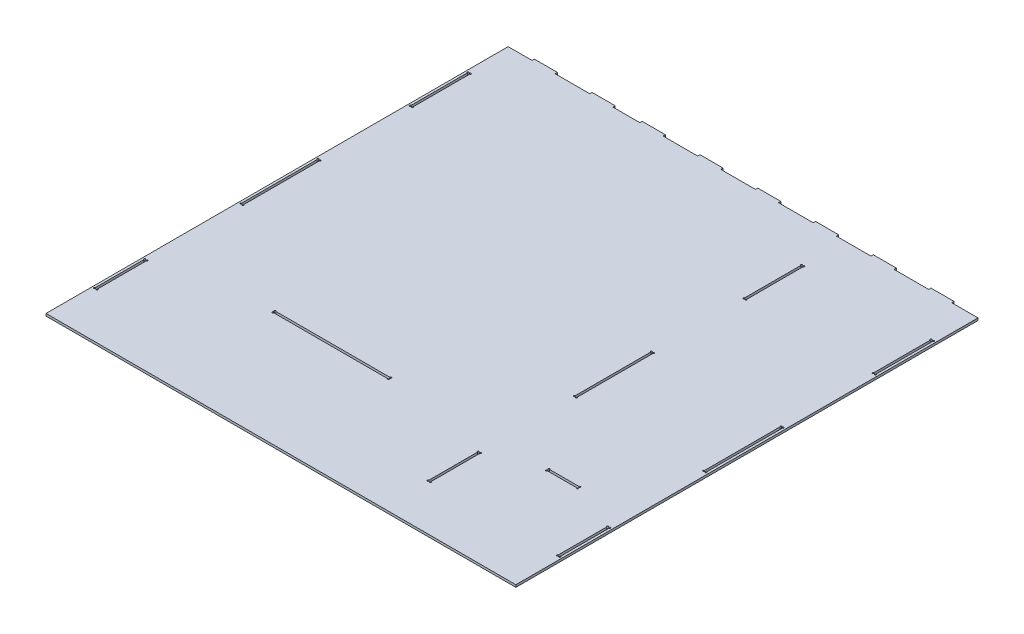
from build123d import *

# Parameters (mm, degrees)
SKETCH1_W             = 50
SKETCH1_H             = 6
BOSS_EXTRUDE1_DEPTH   = 1200
SKETCH1_W_2           = 90
BOSS_EXTRUDE1_2_DEPTH = 1200
SKETCH1_W_3           = 70
BOSS_EXTRUDE1_3_DEPTH = 1200
BOSS_EXTRUDE1_4_DEPTH = 1200
BOSS_EXTRUDE1_5_DEPTH = 1200
BOSS_EXTRUDE1_6_DEPTH = 1200
BOSS_EXTRUDE1_7_DEPTH = 1200
BOSS_EXTRUDE1_8_DEPTH = 1200
SKETCH1_W_4           = 56
BOSS_EXTRUDE1_9_DEPTH = 1200
SKETCH2_W             = 90
SKETCH2_H             = 1200
SKETCH2_W_2           = 60
SKETCH2_H_2           = 6
SKETCH2_W_3           = 60.015443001
BOSS_EXTRUDE2_DEPTH   = 6
SKETCH3_W             = 12
SKETCH3_H             = 6
BOSS_EXTRUDE3_DEPTH   = 1200
CUT_EXTRUDE1_DEPTH    = 151
SKETCH6_R             = 2
CUT_EXTRUDE2_DEPTH    = 10
SKETCH7_R             = 2
CUT_EXTRUDE3_DEPTH    = 10
CUT_EXTRUDE5_DEPTH    = 20


with BuildPart() as part:
    # Sketch1 → Boss-Extrude1 (new body)
    with BuildSketch(Plane.XY):
        with Locations((-573, 171)):
            Rectangle(SKETCH1_W, SKETCH1_H)
    extrude(amount=BOSS_EXTRUDE1_DEPTH)



with BuildPart() as body_2:
    # Sketch1 → Boss-Extrude1 2 (new body)
    with BuildSketch(Plane.XY):
        with Locations((-443, 171)):
            Rectangle(SKETCH1_W_2, SKETCH1_H)
    extrude(amount=BOSS_EXTRUDE1_2_DEPTH)


with BuildPart() as body_3:
    # Sketch1 → Boss-Extrude1 3 (new body)
    with BuildSketch(Plane.XY):
        with Locations((-303, 171)):
            Rectangle(SKETCH1_W_3, SKETCH1_H)
    extrude(amount=BOSS_EXTRUDE1_3_DEPTH)


with BuildPart() as body_4:
    # Sketch1 → Boss-Extrude1 4 (new body)
    with BuildSketch(Plane.XY):
        with Locations((-163, 171)):
            Rectangle(SKETCH1_W_2, SKETCH1_H)
    extrude(amount=BOSS_EXTRUDE1_4_DEPTH)


with BuildPart() as body_5:
    # Sketch1 → Boss-Extrude1 5 (new body)
    with BuildSketch(Plane.XY):
        with Locations((-13, 171)):
            Rectangle(SKETCH1_W_2, SKETCH1_H)
    extrude(amount=BOSS_EXTRUDE1_5_DEPTH)


with BuildPart() as body_6:
    # Sketch1 → Boss-Extrude1 6 (new body)
    with BuildSketch(Plane.XY):
        with Locations((137, 171)):
            Rectangle(SKETCH1_W_2, SKETCH1_H)
    extrude(amount=BOSS_EXTRUDE1_6_DEPTH)


with BuildPart() as body_7:
    # Sketch1 → Boss-Extrude1 7 (new body)
    with BuildSketch(Plane.XY):
        with Locations((287, 171)):
            Rectangle(SKETCH1_W_2, SKETCH1_H)
    extrude(amount=BOSS_EXTRUDE1_7_DEPTH)


with BuildPart() as body_8:
    # Sketch1 → Boss-Extrude1 8 (new body)
    with BuildSketch(Plane.XY):
        with Locations((437, 171)):
            Rectangle(SKETCH1_W_2, SKETCH1_H)
    extrude(amount=BOSS_EXTRUDE1_8_DEPTH)


with BuildPart() as body_9:
    # Sketch1 → Boss-Extrude1 9 (new body)
    with BuildSketch(Plane.XY):
        with Locations((570, 171)):
            Rectangle(SKETCH1_W_4, SKETCH1_H)
    extrude(amount=BOSS_EXTRUDE1_9_DEPTH)


with BuildPart() as part_1:
    add(part.part)

    add(body_2.part)  # Boss-Extrude2 merges body 2

    add(body_3.part)  # Boss-Extrude2 merges body 3

    add(body_4.part)  # Boss-Extrude2 merges body 4

    add(body_5.part)  # Boss-Extrude2 merges body 5

    add(body_6.part)  # Boss-Extrude2 merges body 6

    add(body_7.part)  # Boss-Extrude2 merges body 7

    add(body_8.part)  # Boss-Extrude2 merges body 8

    add(body_9.part)  # Boss-Extrude2 merges body 9
    # Sketch2 → Boss-Extrude2 (add)
    with BuildSketch(Plane.XZ.offset(-168)):
        Polygon((-598, 0), (-548, 0), (-488, 0), (-488, 1200), (-598, 1200), align=None)
        Polygon((-398, 1200), (-398, 0), (-337.984556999, 0), (-268, 0), (-208, 0), (-118, 0), (-58, 0), (32, 0), (92, 0), (182, 0), (242, 0), (332, 0), (392, 0), (482, 0), (542, 0), (598, 0), (598, 1200), align=None)
        with Locations((-443, 600)):
            Rectangle(SKETCH2_W, SKETCH2_H)
        with Locations((-518, -3)):
            Rectangle(SKETCH2_W_2, SKETCH2_H_2)
        with Locations((-367.9922785, -3)):
            Rectangle(SKETCH2_W_3, SKETCH2_H_2)
        with Locations((-238, -3)):
            Rectangle(SKETCH2_W_2, SKETCH2_H_2)
        with Locations((-88, -3)):
            Rectangle(SKETCH2_W_2, SKETCH2_H_2)
        with Locations((62, -3)):
            Rectangle(SKETCH2_W_2, SKETCH2_H_2)
        with Locations((212, -3)):
            Rectangle(SKETCH2_W_2, SKETCH2_H_2)
        with Locations((362, -3)):
            Rectangle(SKETCH2_W_2, SKETCH2_H_2)
        with Locations((512, -3)):
            Rectangle(SKETCH2_W_2, SKETCH2_H_2)
    extrude(amount=-BOSS_EXTRUDE2_DEPTH)

    # Sketch3 → Boss-Extrude3 (add)
    with BuildSketch(Plane.XY.offset(1200)):
        with Locations((604, 171)):
            Rectangle(SKETCH3_W, SKETCH3_H)
        with Locations((-604, 171)):
            Rectangle(SKETCH3_W, SKETCH3_H)
    extrude(amount=-BOSS_EXTRUDE3_DEPTH)

    # Sketch4 → Cut-Extrude1 (cut)
    with BuildSketch(Plane(origin=(0, 174, 0), x_dir=(1, 0, 0), z_dir=(0, 1, 0))):
        with BuildLine():
            ThreePointArc((264, -950), (260.585786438, -948.585786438), (262, -952))
            Line((262, -952), (262, -1078))
            ThreePointArc((262, -1078), (260.585786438, -1081.414213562), (264, -1080))
            Line((264, -1080), (266, -1080))
            ThreePointArc((266, -1080), (269.414213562, -1081.414213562), (268, -1078))
            Line((268, -1078), (268, -952))
            ThreePointArc((268, -952), (269.414213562, -948.585786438), (266, -950))
            Line((266, -950), (264, -950))
        make_face()
        with BuildLine():
            ThreePointArc((264, -500), (260.585786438, -498.585786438), (262, -502))
            Line((262, -502), (262, -698))
            ThreePointArc((262, -698), (263.414213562, -698.585786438), (264, -700))
            Line((264, -700), (266, -700))
            ThreePointArc((266, -700), (266.585786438, -698.585786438), (268, -698))
            Line((268, -698), (268, -502))
            ThreePointArc((268, -502), (269.414213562, -498.585786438), (266, -500))
            Line((266, -500), (264, -500))
        make_face()
        with BuildLine():
            ThreePointArc((264, -110), (260.585786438, -108.585786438), (262, -112))
            Line((262, -112), (262, -258))
            ThreePointArc((262, -258), (260.585786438, -261.414213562), (264, -260))
            Line((264, -260), (266, -260))
            ThreePointArc((266, -260), (269.414213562, -261.414213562), (268, -258))
            Line((268, -258), (268, -112))
            ThreePointArc((268, -112), (269.414213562, -108.585786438), (266, -110))
            Line((266, -110), (264, -110))
        make_face()
        with BuildLine():
            ThreePointArc((-602, -110), (-605.414213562, -108.585786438), (-604, -112))
            Line((-604, -112), (-604, -258))
            ThreePointArc((-604, -258), (-605.414213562, -261.414213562), (-602, -260))
            Line((-602, -260), (-600, -260))
            ThreePointArc((-600, -260), (-596.585786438, -261.414213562), (-598, -258))
            Line((-598, -258), (-598, -112))
            ThreePointArc((-598, -112), (-596.585786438, -108.585786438), (-600, -110))
            Line((-600, -110), (-602, -110))
        make_face()
        with BuildLine():
            ThreePointArc((-602, -500), (-605.414213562, -498.585786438), (-604, -502))
            Line((-604, -502), (-604, -698))
            ThreePointArc((-604, -698), (-605.414213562, -701.414213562), (-602, -700))
            Line((-602, -700), (-600, -700))
            ThreePointArc((-600, -700), (-596.585786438, -701.414213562), (-598, -698))
            Line((-598, -698), (-598, -502))
            ThreePointArc((-598, -502), (-596.585786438, -498.585786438), (-600, -500))
            Line((-600, -500), (-602, -500))
        make_face()
        with BuildLine():
            ThreePointArc((-602, -950), (-605.414213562, -948.585786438), (-604, -952))
            Line((-604, -952), (-604, -1078))
            ThreePointArc((-604, -1078), (-605.414213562, -1081.414213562), (-602, -1080))
            Line((-602, -1080), (-600, -1080))
            ThreePointArc((-600, -1080), (-596.585786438, -1081.414213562), (-598, -1078))
            Line((-598, -1078), (-598, -952))
            ThreePointArc((-598, -952), (-596.585786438, -948.585786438), (-600, -950))
            Line((-600, -950), (-602, -950))
        make_face()
        with BuildLine():
            ThreePointArc((600, -110), (596.585786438, -108.585786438), (598, -112))
            Line((598, -112), (598, -258))
            ThreePointArc((598, -258), (599.414213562, -258.585786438), (600, -260))
            Line((600, -260), (602, -260))
            ThreePointArc((602, -260), (605.414213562, -261.414213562), (604, -258))
            Line((604, -258), (604, -112))
            ThreePointArc((604, -112), (605.414213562, -108.585786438), (602, -110))
            Line((602, -110), (600, -110))
        make_face()
        with BuildLine():
            Line((598, -260), (598, -258))
            ThreePointArc((598, -258), (596.585786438, -261.414213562), (600, -260))
            Line((600, -260), (598, -260))
        make_face()
        with BuildLine():
            ThreePointArc((600, -500), (596.585786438, -498.585786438), (598, -502))
            Line((598, -502), (598, -698))
            ThreePointArc((598, -698), (596.585786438, -701.414213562), (600, -700))
            Line((600, -700), (602, -700))
            ThreePointArc((602, -700), (605.414213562, -701.414213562), (604, -698))
            Line((604, -698), (604, -502))
            ThreePointArc((604, -502), (605.414213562, -498.585786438), (602, -500))
            Line((602, -500), (600, -500))
        make_face()
        with BuildLine():
            ThreePointArc((600, -950), (596.585786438, -948.585786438), (598, -952))
            Line((598, -952), (598, -1078))
            ThreePointArc((598, -1078), (596.585786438, -1081.414213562), (600, -1080))
            Line((600, -1080), (602, -1080))
            ThreePointArc((602, -1080), (605.414213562, -1081.414213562), (604, -1078))
            Line((604, -1078), (604, -952))
            ThreePointArc((604, -952), (605.414213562, -948.585786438), (602, -950))
            Line((602, -950), (600, -950))
        make_face()
    extrude(amount=-CUT_EXTRUDE1_DEPTH, mode=Mode.SUBTRACT)


with BuildPart() as cut_extrude1_piece_1:
    # of the separate pieces the step leaves, piece 1, a body of its own (cut_extrude1_pieces)
    add(part_1.part.solids().sort_by_distance((-610, 174, 1200))[0])

    # Sketch7 → Cut-Extrude3 (cut)
    with BuildSketch(Plane(origin=(0, 168, 0), x_dir=(-1, 0, 0), z_dir=(0, -1, 0))):
        with Locations((-268, -700)):
            Circle(SKETCH7_R)
        with Locations((-262, -700)):
            Circle(SKETCH7_R)
    extrude(amount=-CUT_EXTRUDE3_DEPTH, mode=Mode.SUBTRACT)

    # Sketch8 → Cut-Extrude5 (cut)
    with BuildSketch(Plane(origin=(0, 174, 0), x_dir=(1, 0, 0), z_dir=(0, 1, 0))):
        with BuildLine():
            Line((-316, -897), (-20, -897))
            ThreePointArc((-20, -897), (-16.585786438, -895.585786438), (-18, -899))
            Line((-18, -899), (-18, -901))
            ThreePointArc((-18, -901), (-16.585786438, -904.414213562), (-20, -903))
            Line((-20, -903), (-316, -903))
            ThreePointArc((-316, -903), (-319.414213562, -904.414213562), (-318, -901))
            Line((-318, -901), (-318, -899))
            ThreePointArc((-318, -899), (-319.414213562, -895.585786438), (-316, -897))
        make_face()
        with BuildLine():
            Line((395, -897), (471, -897))
            ThreePointArc((471, -897), (474.414213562, -895.585786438), (473, -899))
            Line((473, -899), (473, -901))
            ThreePointArc((473, -901), (474.414213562, -904.414213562), (471, -903))
            Line((471, -903), (395, -903))
            ThreePointArc((395, -903), (391.585786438, -904.414213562), (393, -901))
            Line((393, -901), (393, -899))
            ThreePointArc((393, -899), (391.585786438, -895.585786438), (395, -897))
        make_face()
    extrude(amount=-CUT_EXTRUDE5_DEPTH, mode=Mode.SUBTRACT)


with BuildPart() as cut_extrude1_piece_2:
    # of the separate pieces the step leaves, piece 2, a body of its own (cut_extrude1_pieces)
    add(part_1.part.solids().sort_by_distance((598, 168, 260))[0])

    # Sketch6 → Cut-Extrude2 (cut)
    with BuildSketch(Plane(origin=(0, 168, 0), x_dir=(-1, 0, 0), z_dir=(0, -1, 0))):
        with Locations((-598, -260)):
            Circle(SKETCH6_R)
    extrude(amount=-CUT_EXTRUDE2_DEPTH, mode=Mode.SUBTRACT)


solid = cut_extrude1_piece_1.part
